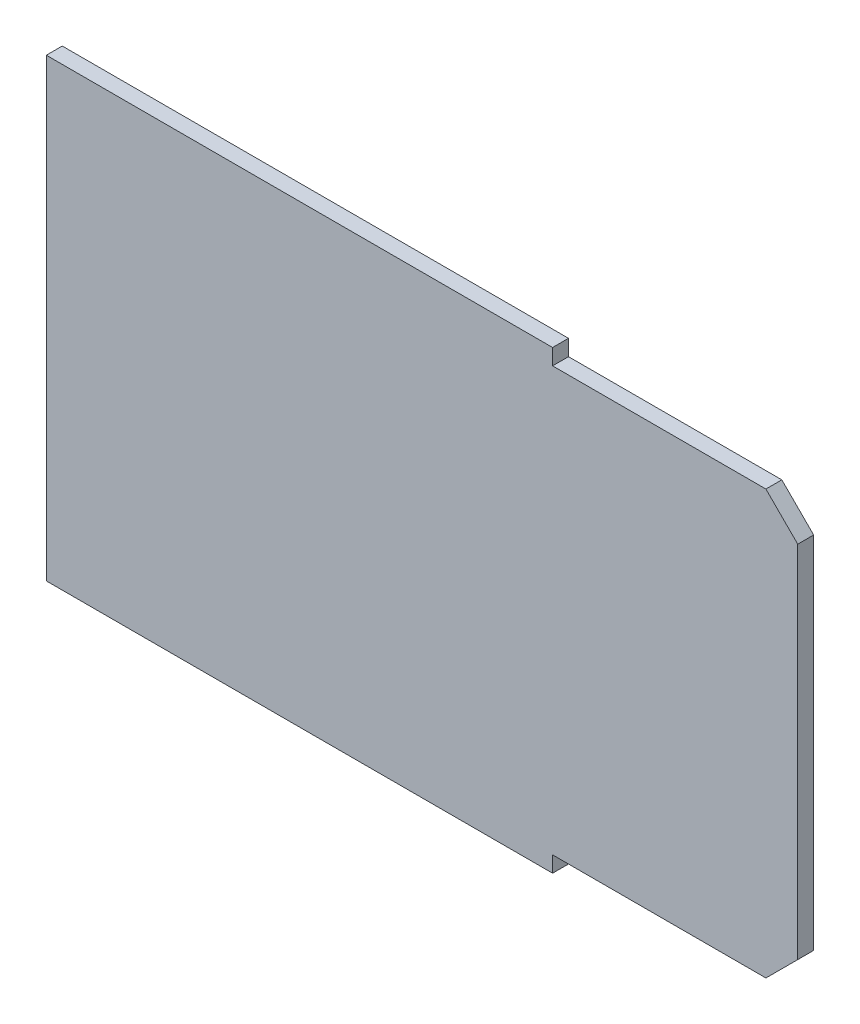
ISO-10303-21;
HEADER;
FILE_DESCRIPTION(('STEP AP214'),'2;1');
FILE_NAME('part.step','',(''),(''),'','','');
FILE_SCHEMA(('AUTOMOTIVE_DESIGN { 1 0 10303 214 1 1 1 1 }'));
ENDSEC;
DATA;
#1=APPLICATION_CONTEXT('core data for automotive mechanical design processes');
#2=APPLICATION_PROTOCOL_DEFINITION('international standard','automotive_design',2000,#1);
#3=PRODUCT_CONTEXT('',#1,'mechanical');
#4=PRODUCT('Part','Part','',(#3));
#5=PRODUCT_RELATED_PRODUCT_CATEGORY('part','',(#4));
#6=PRODUCT_DEFINITION_FORMATION('','',#4);
#7=PRODUCT_DEFINITION_CONTEXT('part definition',#1,'design');
#8=PRODUCT_DEFINITION('design','',#6,#7);
#9=PRODUCT_DEFINITION_SHAPE('','',#8);
#10=(LENGTH_UNIT() NAMED_UNIT(*) SI_UNIT(.MILLI.,.METRE.));
#11=(NAMED_UNIT(*) PLANE_ANGLE_UNIT() SI_UNIT($,.RADIAN.));
#12=(NAMED_UNIT(*) SI_UNIT($,.STERADIAN.) SOLID_ANGLE_UNIT());
#13=UNCERTAINTY_MEASURE_WITH_UNIT(LENGTH_MEASURE(1.E-05),#10,'distance_accuracy_value','');
#14=(GEOMETRIC_REPRESENTATION_CONTEXT(3) GLOBAL_UNCERTAINTY_ASSIGNED_CONTEXT((#13)) GLOBAL_UNIT_ASSIGNED_CONTEXT((#10,
#11,#12)) REPRESENTATION_CONTEXT('',''));
#15=CARTESIAN_POINT('',(0.,0.,0.));
#16=DIRECTION('',(0.,0.,1.));
#17=DIRECTION('',(1.,0.,0.));
#18=AXIS2_PLACEMENT_3D('',#15,#16,#17);
#19=CARTESIAN_POINT('',(236.,5.00000000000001,5.));
#20=DIRECTION('',(0.,1.,0.));
#21=DIRECTION('',(-1.,0.,0.));
#22=AXIS2_PLACEMENT_3D('',#19,#20,#21);
#23=PLANE('',#22);
#24=DIRECTION('',(1.,0.,0.));
#25=VECTOR('',#24,1.);
#26=CARTESIAN_POINT('',(236.,5.00000000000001,0.));
#27=LINE('',#26,#25);
#28=CARTESIAN_POINT('',(159.,5.,0.));
#29=VERTEX_POINT('',#28);
#30=CARTESIAN_POINT('',(226.,5.00000000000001,0.));
#31=VERTEX_POINT('',#30);
#32=EDGE_CURVE('E194',#29,#31,#27,.T.);
#33=ORIENTED_EDGE('',*,*,#32,.T.);
#34=DIRECTION('',(0.,0.,1.));
#35=VECTOR('',#34,1.);
#36=CARTESIAN_POINT('',(226.,5.00000000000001,5.));
#37=LINE('',#36,#35);
#38=CARTESIAN_POINT('',(226.,5.00000000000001,5.));
#39=VERTEX_POINT('',#38);
#40=EDGE_CURVE('E54',#31,#39,#37,.T.);
#41=ORIENTED_EDGE('',*,*,#40,.T.);
#42=DIRECTION('',(1.,0.,0.));
#43=VECTOR('',#42,1.);
#44=CARTESIAN_POINT('',(236.,5.00000000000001,5.));
#45=LINE('',#44,#43);
#46=CARTESIAN_POINT('',(159.,5.,5.));
#47=VERTEX_POINT('',#46);
#48=EDGE_CURVE('E145',#47,#39,#45,.T.);
#49=ORIENTED_EDGE('',*,*,#48,.F.);
#50=DIRECTION('',(0.,0.,-1.));
#51=VECTOR('',#50,1.);
#52=CARTESIAN_POINT('',(159.,5.,5.));
#53=LINE('',#52,#51);
#54=EDGE_CURVE('E160',#47,#29,#53,.T.);
#55=ORIENTED_EDGE('',*,*,#54,.T.);
#56=EDGE_LOOP('',(#33,#41,#49,#55));
#57=FACE_BOUND('',#56,.T.);
#58=ADVANCED_FACE('F32',(#57),#23,.F.);
#59=CARTESIAN_POINT('',(236.,138.,5.));
#60=DIRECTION('',(-1.,0.,0.));
#61=DIRECTION('',(0.,0.,1.));
#62=AXIS2_PLACEMENT_3D('',#59,#60,#61);
#63=PLANE('',#62);
#64=DIRECTION('',(0.,1.,0.));
#65=VECTOR('',#64,1.);
#66=CARTESIAN_POINT('',(236.,138.,5.));
#67=LINE('',#66,#65);
#68=CARTESIAN_POINT('',(236.,15.,5.));
#69=VERTEX_POINT('',#68);
#70=CARTESIAN_POINT('',(236.,128.,5.));
#71=VERTEX_POINT('',#70);
#72=EDGE_CURVE('E147',#69,#71,#67,.T.);
#73=ORIENTED_EDGE('',*,*,#72,.F.);
#74=DIRECTION('',(0.,0.,-1.));
#75=VECTOR('',#74,1.);
#76=CARTESIAN_POINT('',(236.,15.,5.));
#77=LINE('',#76,#75);
#78=CARTESIAN_POINT('',(236.,15.,0.));
#79=VERTEX_POINT('',#78);
#80=EDGE_CURVE('E174',#69,#79,#77,.T.);
#81=ORIENTED_EDGE('',*,*,#80,.T.);
#82=DIRECTION('',(0.,1.,0.));
#83=VECTOR('',#82,1.);
#84=CARTESIAN_POINT('',(236.,138.,0.));
#85=LINE('',#84,#83);
#86=CARTESIAN_POINT('',(236.,128.,0.));
#87=VERTEX_POINT('',#86);
#88=EDGE_CURVE('E120',#79,#87,#85,.T.);
#89=ORIENTED_EDGE('',*,*,#88,.T.);
#90=DIRECTION('',(0.,0.,1.));
#91=VECTOR('',#90,1.);
#92=CARTESIAN_POINT('',(236.,128.,5.));
#93=LINE('',#92,#91);
#94=EDGE_CURVE('E127',#87,#71,#93,.T.);
#95=ORIENTED_EDGE('',*,*,#94,.T.);
#96=EDGE_LOOP('',(#73,#81,#89,#95));
#97=FACE_BOUND('',#96,.T.);
#98=ADVANCED_FACE('F188',(#97),#63,.F.);
#99=CARTESIAN_POINT('',(159.,138.,5.));
#100=DIRECTION('',(0.,-1.,0.));
#101=DIRECTION('',(0.,0.,-1.));
#102=AXIS2_PLACEMENT_3D('',#99,#100,#101);
#103=PLANE('',#102);
#104=DIRECTION('',(-1.,0.,0.));
#105=VECTOR('',#104,1.);
#106=CARTESIAN_POINT('',(159.,138.,5.));
#107=LINE('',#106,#105);
#108=CARTESIAN_POINT('',(226.,138.,5.));
#109=VERTEX_POINT('',#108);
#110=CARTESIAN_POINT('',(159.,138.,5.));
#111=VERTEX_POINT('',#110);
#112=EDGE_CURVE('E149',#109,#111,#107,.T.);
#113=ORIENTED_EDGE('',*,*,#112,.F.);
#114=DIRECTION('',(0.,0.,-1.));
#115=VECTOR('',#114,1.);
#116=CARTESIAN_POINT('',(226.,138.,5.));
#117=LINE('',#116,#115);
#118=CARTESIAN_POINT('',(226.,138.,0.));
#119=VERTEX_POINT('',#118);
#120=EDGE_CURVE('E11',#109,#119,#117,.T.);
#121=ORIENTED_EDGE('',*,*,#120,.T.);
#122=DIRECTION('',(-1.,0.,0.));
#123=VECTOR('',#122,1.);
#124=CARTESIAN_POINT('',(159.,138.,0.));
#125=LINE('',#124,#123);
#126=CARTESIAN_POINT('',(159.,138.,0.));
#127=VERTEX_POINT('',#126);
#128=EDGE_CURVE('E111',#119,#127,#125,.T.);
#129=ORIENTED_EDGE('',*,*,#128,.T.);
#130=DIRECTION('',(0.,0.,-1.));
#131=VECTOR('',#130,1.);
#132=CARTESIAN_POINT('',(159.,138.,5.));
#133=LINE('',#132,#131);
#134=EDGE_CURVE('E114',#111,#127,#133,.T.);
#135=ORIENTED_EDGE('',*,*,#134,.F.);
#136=EDGE_LOOP('',(#113,#121,#129,#135));
#137=FACE_BOUND('',#136,.T.);
#138=ADVANCED_FACE('F113',(#137),#103,.F.);
#139=CARTESIAN_POINT('',(159.,143.,5.));
#140=DIRECTION('',(-1.,0.,0.));
#141=DIRECTION('',(0.,0.,1.));
#142=AXIS2_PLACEMENT_3D('',#139,#140,#141);
#143=PLANE('',#142);
#144=DIRECTION('',(0.,1.,0.));
#145=VECTOR('',#144,1.);
#146=CARTESIAN_POINT('',(159.,143.,0.));
#147=LINE('',#146,#145);
#148=CARTESIAN_POINT('',(159.,143.,0.));
#149=VERTEX_POINT('',#148);
#150=EDGE_CURVE('E119',#127,#149,#147,.T.);
#151=ORIENTED_EDGE('',*,*,#150,.T.);
#152=DIRECTION('',(0.,0.,-1.));
#153=VECTOR('',#152,1.);
#154=CARTESIAN_POINT('',(159.,143.,5.));
#155=LINE('',#154,#153);
#156=CARTESIAN_POINT('',(159.,143.,5.));
#157=VERTEX_POINT('',#156);
#158=EDGE_CURVE('E128',#157,#149,#155,.T.);
#159=ORIENTED_EDGE('',*,*,#158,.F.);
#160=DIRECTION('',(0.,1.,0.));
#161=VECTOR('',#160,1.);
#162=CARTESIAN_POINT('',(159.,143.,5.));
#163=LINE('',#162,#161);
#164=EDGE_CURVE('E126',#111,#157,#163,.T.);
#165=ORIENTED_EDGE('',*,*,#164,.F.);
#166=ORIENTED_EDGE('',*,*,#134,.T.);
#167=EDGE_LOOP('',(#151,#159,#165,#166));
#168=FACE_BOUND('',#167,.T.);
#169=ADVANCED_FACE('F123',(#168),#143,.F.);
#170=CARTESIAN_POINT('',(0.,143.,5.));
#171=DIRECTION('',(0.,-1.,0.));
#172=DIRECTION('',(0.,0.,-1.));
#173=AXIS2_PLACEMENT_3D('',#170,#171,#172);
#174=PLANE('',#173);
#175=DIRECTION('',(-1.,0.,0.));
#176=VECTOR('',#175,1.);
#177=CARTESIAN_POINT('',(0.,143.,0.));
#178=LINE('',#177,#176);
#179=CARTESIAN_POINT('',(0.,143.,0.));
#180=VERTEX_POINT('',#179);
#181=EDGE_CURVE('E134',#149,#180,#178,.T.);
#182=ORIENTED_EDGE('',*,*,#181,.T.);
#183=DIRECTION('',(0.,0.,-1.));
#184=VECTOR('',#183,1.);
#185=CARTESIAN_POINT('',(0.,143.,5.));
#186=LINE('',#185,#184);
#187=CARTESIAN_POINT('',(0.,143.,5.));
#188=VERTEX_POINT('',#187);
#189=EDGE_CURVE('E169',#188,#180,#186,.T.);
#190=ORIENTED_EDGE('',*,*,#189,.F.);
#191=DIRECTION('',(-1.,0.,0.));
#192=VECTOR('',#191,1.);
#193=CARTESIAN_POINT('',(0.,143.,5.));
#194=LINE('',#193,#192);
#195=EDGE_CURVE('E152',#157,#188,#194,.T.);
#196=ORIENTED_EDGE('',*,*,#195,.F.);
#197=ORIENTED_EDGE('',*,*,#158,.T.);
#198=EDGE_LOOP('',(#182,#190,#196,#197));
#199=FACE_BOUND('',#198,.T.);
#200=ADVANCED_FACE('F216',(#199),#174,.F.);
#201=CARTESIAN_POINT('',(0.,0.,5.));
#202=DIRECTION('',(1.,0.,0.));
#203=DIRECTION('',(0.,0.,-1.));
#204=AXIS2_PLACEMENT_3D('',#201,#202,#203);
#205=PLANE('',#204);
#206=DIRECTION('',(0.,-1.,0.));
#207=VECTOR('',#206,1.);
#208=CARTESIAN_POINT('',(0.,0.,0.));
#209=LINE('',#208,#207);
#210=CARTESIAN_POINT('',(0.,0.,0.));
#211=VERTEX_POINT('',#210);
#212=EDGE_CURVE('E136',#180,#211,#209,.T.);
#213=ORIENTED_EDGE('',*,*,#212,.T.);
#214=DIRECTION('',(0.,0.,-1.));
#215=VECTOR('',#214,1.);
#216=CARTESIAN_POINT('',(0.,0.,5.));
#217=LINE('',#216,#215);
#218=CARTESIAN_POINT('',(0.,0.,5.));
#219=VERTEX_POINT('',#218);
#220=EDGE_CURVE('E166',#219,#211,#217,.T.);
#221=ORIENTED_EDGE('',*,*,#220,.F.);
#222=DIRECTION('',(0.,-1.,0.));
#223=VECTOR('',#222,1.);
#224=CARTESIAN_POINT('',(0.,0.,5.));
#225=LINE('',#224,#223);
#226=EDGE_CURVE('E154',#188,#219,#225,.T.);
#227=ORIENTED_EDGE('',*,*,#226,.F.);
#228=ORIENTED_EDGE('',*,*,#189,.T.);
#229=EDGE_LOOP('',(#213,#221,#227,#228));
#230=FACE_BOUND('',#229,.T.);
#231=ADVANCED_FACE('F219',(#230),#205,.F.);
#232=CARTESIAN_POINT('',(159.,0.,5.));
#233=DIRECTION('',(0.,1.,0.));
#234=DIRECTION('',(-1.,0.,0.));
#235=AXIS2_PLACEMENT_3D('',#232,#233,#234);
#236=PLANE('',#235);
#237=DIRECTION('',(1.,0.,0.));
#238=VECTOR('',#237,1.);
#239=CARTESIAN_POINT('',(159.,0.,0.));
#240=LINE('',#239,#238);
#241=CARTESIAN_POINT('',(159.,0.,0.));
#242=VERTEX_POINT('',#241);
#243=EDGE_CURVE('E141',#211,#242,#240,.T.);
#244=ORIENTED_EDGE('',*,*,#243,.T.);
#245=DIRECTION('',(0.,0.,-1.));
#246=VECTOR('',#245,1.);
#247=CARTESIAN_POINT('',(159.,0.,5.));
#248=LINE('',#247,#246);
#249=CARTESIAN_POINT('',(159.,0.,5.));
#250=VERTEX_POINT('',#249);
#251=EDGE_CURVE('E163',#250,#242,#248,.T.);
#252=ORIENTED_EDGE('',*,*,#251,.F.);
#253=DIRECTION('',(1.,0.,0.));
#254=VECTOR('',#253,1.);
#255=CARTESIAN_POINT('',(159.,0.,5.));
#256=LINE('',#255,#254);
#257=EDGE_CURVE('E156',#219,#250,#256,.T.);
#258=ORIENTED_EDGE('',*,*,#257,.F.);
#259=ORIENTED_EDGE('',*,*,#220,.T.);
#260=EDGE_LOOP('',(#244,#252,#258,#259));
#261=FACE_BOUND('',#260,.T.);
#262=ADVANCED_FACE('F223',(#261),#236,.F.);
#263=CARTESIAN_POINT('',(159.,5.,5.));
#264=DIRECTION('',(-1.,0.,0.));
#265=DIRECTION('',(0.,0.,1.));
#266=AXIS2_PLACEMENT_3D('',#263,#264,#265);
#267=PLANE('',#266);
#268=DIRECTION('',(0.,1.,0.));
#269=VECTOR('',#268,1.);
#270=CARTESIAN_POINT('',(159.,5.,0.));
#271=LINE('',#270,#269);
#272=EDGE_CURVE('E143',#242,#29,#271,.T.);
#273=ORIENTED_EDGE('',*,*,#272,.T.);
#274=ORIENTED_EDGE('',*,*,#54,.F.);
#275=DIRECTION('',(0.,1.,0.));
#276=VECTOR('',#275,1.);
#277=CARTESIAN_POINT('',(159.,5.,5.));
#278=LINE('',#277,#276);
#279=EDGE_CURVE('E158',#250,#47,#278,.T.);
#280=ORIENTED_EDGE('',*,*,#279,.F.);
#281=ORIENTED_EDGE('',*,*,#251,.T.);
#282=EDGE_LOOP('',(#273,#274,#280,#281));
#283=FACE_BOUND('',#282,.T.);
#284=ADVANCED_FACE('F227',(#283),#267,.F.);
#285=CARTESIAN_POINT('',(159.,5.,5.));
#286=DIRECTION('',(0.,0.,1.));
#287=DIRECTION('',(1.,0.,0.));
#288=AXIS2_PLACEMENT_3D('',#285,#286,#287);
#289=PLANE('',#288);
#290=ORIENTED_EDGE('',*,*,#48,.T.);
#291=DIRECTION('',(-0.707106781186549,-0.707106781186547,0.));
#292=VECTOR('',#291,1.);
#293=CARTESIAN_POINT('',(192.5,-28.5,5.));
#294=LINE('',#293,#292);
#295=EDGE_CURVE('E39',#39,#69,#294,.F.);
#296=ORIENTED_EDGE('',*,*,#295,.T.);
#297=ORIENTED_EDGE('',*,*,#72,.T.);
#298=DIRECTION('',(0.707106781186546,-0.707106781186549,0.));
#299=VECTOR('',#298,1.);
#300=CARTESIAN_POINT('',(259.,105.,5.));
#301=LINE('',#300,#299);
#302=EDGE_CURVE('E46',#71,#109,#301,.F.);
#303=ORIENTED_EDGE('',*,*,#302,.T.);
#304=ORIENTED_EDGE('',*,*,#112,.T.);
#305=ORIENTED_EDGE('',*,*,#164,.T.);
#306=ORIENTED_EDGE('',*,*,#195,.T.);
#307=ORIENTED_EDGE('',*,*,#226,.T.);
#308=ORIENTED_EDGE('',*,*,#257,.T.);
#309=ORIENTED_EDGE('',*,*,#279,.T.);
#310=EDGE_LOOP('',(#290,#296,#297,#303,#304,#305,#306,#307,#308,#309));
#311=FACE_BOUND('',#310,.T.);
#312=ADVANCED_FACE('F184',(#311),#289,.T.);
#313=CARTESIAN_POINT('',(159.,5.,0.));
#314=DIRECTION('',(0.,0.,1.));
#315=DIRECTION('',(1.,0.,0.));
#316=AXIS2_PLACEMENT_3D('',#313,#314,#315);
#317=PLANE('',#316);
#318=ORIENTED_EDGE('',*,*,#88,.F.);
#319=DIRECTION('',(0.707106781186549,0.707106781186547,0.));
#320=VECTOR('',#319,1.);
#321=CARTESIAN_POINT('',(236.,15.,0.));
#322=LINE('',#321,#320);
#323=EDGE_CURVE('E179',#79,#31,#322,.F.);
#324=ORIENTED_EDGE('',*,*,#323,.T.);
#325=ORIENTED_EDGE('',*,*,#32,.F.);
#326=ORIENTED_EDGE('',*,*,#272,.F.);
#327=ORIENTED_EDGE('',*,*,#243,.F.);
#328=ORIENTED_EDGE('',*,*,#212,.F.);
#329=ORIENTED_EDGE('',*,*,#181,.F.);
#330=ORIENTED_EDGE('',*,*,#150,.F.);
#331=ORIENTED_EDGE('',*,*,#128,.F.);
#332=DIRECTION('',(-0.707106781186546,0.707106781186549,0.));
#333=VECTOR('',#332,1.);
#334=CARTESIAN_POINT('',(226.,138.,0.));
#335=LINE('',#334,#333);
#336=EDGE_CURVE('E177',#119,#87,#335,.F.);
#337=ORIENTED_EDGE('',*,*,#336,.T.);
#338=EDGE_LOOP('',(#318,#324,#325,#326,#327,#328,#329,#330,#331,#337));
#339=FACE_BOUND('',#338,.T.);
#340=ADVANCED_FACE('F132',(#339),#317,.F.);
#341=CARTESIAN_POINT('',(236.,15.,5.));
#342=DIRECTION('',(-0.707106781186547,0.707106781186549,0.));
#343=DIRECTION('',(-0.707106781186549,-0.707106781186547,0.));
#344=AXIS2_PLACEMENT_3D('',#341,#342,#343);
#345=PLANE('',#344);
#346=ORIENTED_EDGE('',*,*,#295,.F.);
#347=ORIENTED_EDGE('',*,*,#40,.F.);
#348=ORIENTED_EDGE('',*,*,#323,.F.);
#349=ORIENTED_EDGE('',*,*,#80,.F.);
#350=EDGE_LOOP('',(#346,#347,#348,#349));
#351=FACE_BOUND('',#350,.T.);
#352=ADVANCED_FACE('F191',(#351),#345,.F.);
#353=CARTESIAN_POINT('',(226.,138.,5.));
#354=DIRECTION('',(-0.707106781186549,-0.707106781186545,0.));
#355=DIRECTION('',(0.707106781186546,-0.707106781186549,0.));
#356=AXIS2_PLACEMENT_3D('',#353,#354,#355);
#357=PLANE('',#356);
#358=ORIENTED_EDGE('',*,*,#302,.F.);
#359=ORIENTED_EDGE('',*,*,#94,.F.);
#360=ORIENTED_EDGE('',*,*,#336,.F.);
#361=ORIENTED_EDGE('',*,*,#120,.F.);
#362=EDGE_LOOP('',(#358,#359,#360,#361));
#363=FACE_BOUND('',#362,.T.);
#364=ADVANCED_FACE('F198',(#363),#357,.F.);
#365=CLOSED_SHELL('',(#58,#98,#138,#169,#200,#231,#262,#284,#312,#340,#352,#364));
#366=MANIFOLD_SOLID_BREP('B2',#365);
#367=ADVANCED_BREP_SHAPE_REPRESENTATION('',(#18,#366),#14);
#368=SHAPE_DEFINITION_REPRESENTATION(#9,#367);
ENDSEC;
END-ISO-10303-21;
